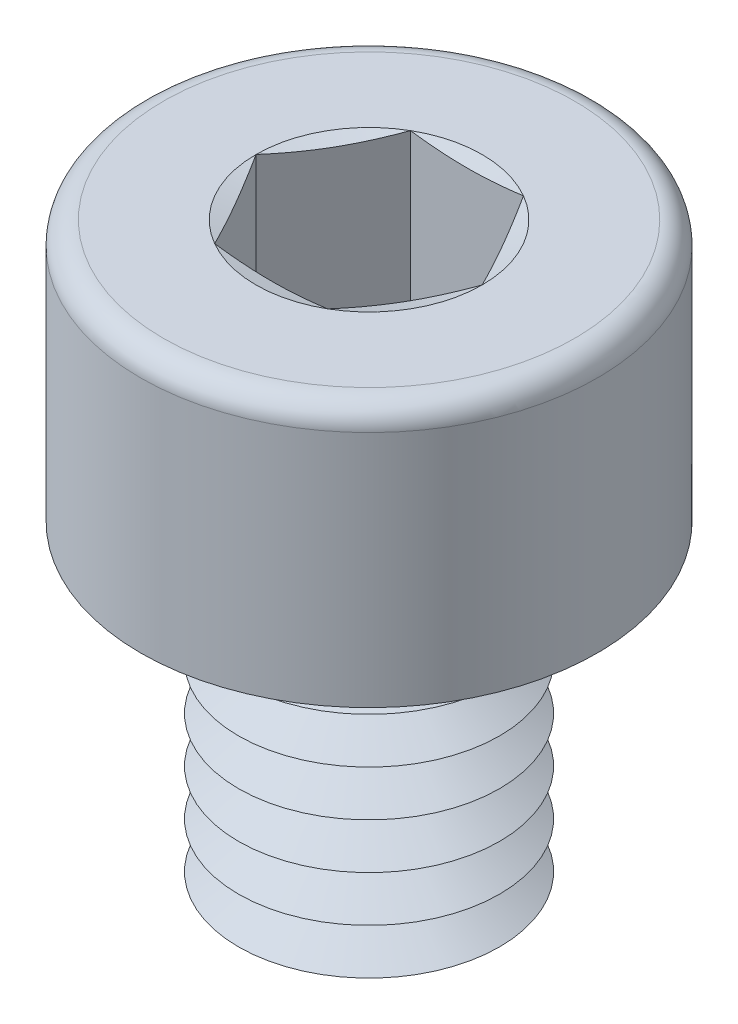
from build123d import *

# Parameters (mm, degrees)
SKETCH1_R       = 2
EXTRUDE1_DEPTH  = 5
SKETCH2_R       = 3.5
EXTRUDE2_DEPTH  = 4
EXTRUDE3_DEPTH  = 3
FILLET1_R       = 0.35
LPATTERN1_COUNT = 7
LPATTERN1_PITCH = 0.7


with BuildPart() as part:
    # Sketch1 → Extrude1 (new body)
    with BuildSketch(Plane(origin=(0, 0, 0), x_dir=(1, 0, 0), z_dir=(0, 1, 0))):
        with Locations(Location((0, 0, 0), (0, 0, 270))):
            Circle(SKETCH1_R)
    extrude(amount=EXTRUDE1_DEPTH)

    # Sketch2 → Extrude2 (add)
    with BuildSketch(Plane(origin=(0, 5, 0), x_dir=(1, 0, 0), z_dir=(0, 1, 0))):
        with Locations(Location((0, 0, 0), (0, 0, 270))):
            Circle(SKETCH2_R)
    extrude(amount=EXTRUDE2_DEPTH)

    # Sketch3 → Extrude3 (cut)
    with BuildSketch(Plane(origin=(0, 9, 0), x_dir=(1, 0, 0), z_dir=(0, 1, 0))):
        Polygon((0.866025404, 1.5), (-0.866025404, 1.5), (-1.732050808, 0), (-0.866025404, -1.5), (0.866025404, -1.5), (1.732050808, 0), align=None)
    extrude(amount=-EXTRUDE3_DEPTH, mode=Mode.SUBTRACT)

    # Fillet1
    fillet1_edges = [part.edges().sort_by_distance(p)[0] for p in [
        (0, 9, -3.5),
    ]]
    fillet(fillet1_edges, radius=FILLET1_R)

    # Sketch4 → Cut-Revolve1 (revolve, cut)
    with BuildSketch(Plane(origin=(0, 0, 0), x_dir=(0, 0, -1), z_dir=(1, 0, 0))):
        Polygon((-1.5, 6), (0, 6), (0, 5.133974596), align=None)
    revolve(axis=Axis((0, 6, 0), (0, -1, 0)), mode=Mode.SUBTRACT)

    # Sketch5 → Cut-Revolve2 (revolve, cut)
    with BuildSketch(Plane.XY, mode=Mode.PRIVATE) as cut_revolve2_sk:
        Polygon((-2, 0.35), (-2, -0.35), (-1.393782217, 0), align=None)
    cut_revolve2 = revolve(cut_revolve2_sk.sketch.rotate(Axis((0, 5, 0), (0, -1, 0)), 270), axis=Axis((0, 5, 0), (0, -1, 0)), mode=Mode.SUBTRACT)

    # LPattern1: Cut-Revolve2 ×7
    with Locations(*[(0, i * LPATTERN1_PITCH, 0) for i in range(1, LPATTERN1_COUNT)]):
        add(cut_revolve2, mode=Mode.SUBTRACT)

    # Extrude4 cone 1 section (on through the dimple's axis) → Extrude4 (revolve, cut)
    with BuildSketch(Plane(origin=(0, 9, 0), x_dir=(0, 0, 1), z_dir=(1, 0, 0))):
        Polygon((0, 0), (1.732050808, 0), (0, 0.464101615), align=None)
    revolve(axis=Axis((0, 9, 0), (0, -1, 0)), mode=Mode.SUBTRACT)


solid = part.part
